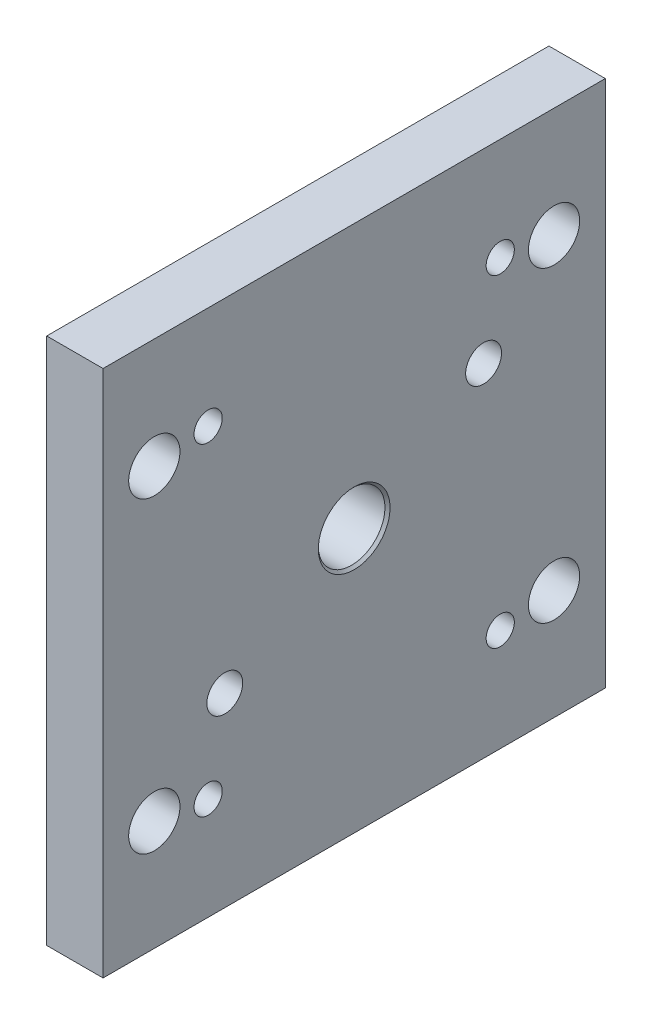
ISO-10303-21;
HEADER;
FILE_DESCRIPTION(('STEP AP214'),'2;1');
FILE_NAME('part.step','',(''),(''),'','','');
FILE_SCHEMA(('AUTOMOTIVE_DESIGN { 1 0 10303 214 1 1 1 1 }'));
ENDSEC;
DATA;
#1=APPLICATION_CONTEXT('core data for automotive mechanical design processes');
#2=APPLICATION_PROTOCOL_DEFINITION('international standard','automotive_design',2000,#1);
#3=PRODUCT_CONTEXT('',#1,'mechanical');
#4=PRODUCT('Part','Part','',(#3));
#5=PRODUCT_RELATED_PRODUCT_CATEGORY('part','',(#4));
#6=PRODUCT_DEFINITION_FORMATION('','',#4);
#7=PRODUCT_DEFINITION_CONTEXT('part definition',#1,'design');
#8=PRODUCT_DEFINITION('design','',#6,#7);
#9=PRODUCT_DEFINITION_SHAPE('','',#8);
#10=(LENGTH_UNIT() NAMED_UNIT(*) SI_UNIT(.MILLI.,.METRE.));
#11=(NAMED_UNIT(*) PLANE_ANGLE_UNIT() SI_UNIT($,.RADIAN.));
#12=(NAMED_UNIT(*) SI_UNIT($,.STERADIAN.) SOLID_ANGLE_UNIT());
#13=UNCERTAINTY_MEASURE_WITH_UNIT(LENGTH_MEASURE(1.E-05),#10,'distance_accuracy_value','');
#14=(GEOMETRIC_REPRESENTATION_CONTEXT(3) GLOBAL_UNCERTAINTY_ASSIGNED_CONTEXT((#13)) GLOBAL_UNIT_ASSIGNED_CONTEXT((#10,
#11,#12)) REPRESENTATION_CONTEXT('',''));
#15=CARTESIAN_POINT('',(0.,0.,0.));
#16=DIRECTION('',(0.,0.,1.));
#17=DIRECTION('',(1.,0.,0.));
#18=AXIS2_PLACEMENT_3D('',#15,#16,#17);
#19=CARTESIAN_POINT('',(0.,0.,0.));
#20=DIRECTION('',(1.,0.,0.));
#21=DIRECTION('',(0.,0.,-1.));
#22=AXIS2_PLACEMENT_3D('',#19,#20,#21);
#23=PLANE('',#22);
#24=CARTESIAN_POINT('',(0.,0.,0.));
#25=DIRECTION('',(1.,0.,0.));
#26=DIRECTION('',(0.,1.,0.));
#27=AXIS2_PLACEMENT_3D('',#24,#25,#26);
#28=CIRCLE('',#27,14.);
#29=CARTESIAN_POINT('',(0.,14.,0.));
#30=VERTEX_POINT('',#29);
#31=EDGE_CURVE('E48',#30,#30,#28,.F.);
#32=ORIENTED_EDGE('',*,*,#31,.T.);
#33=EDGE_LOOP('',(#32));
#34=FACE_BOUND('',#33,.T.);
#35=CARTESIAN_POINT('',(0.,30.5,-50.5000000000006));
#36=DIRECTION('',(-1.,0.,0.));
#37=DIRECTION('',(0.,0.,1.));
#38=AXIS2_PLACEMENT_3D('',#35,#36,#37);
#39=CIRCLE('',#38,6.99999999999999);
#40=CARTESIAN_POINT('',(0.,30.5,-43.5000000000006));
#41=VERTEX_POINT('',#40);
#42=EDGE_CURVE('E160',#41,#41,#39,.T.);
#43=ORIENTED_EDGE('',*,*,#42,.T.);
#44=EDGE_LOOP('',(#43));
#45=FACE_BOUND('',#44,.T.);
#46=CARTESIAN_POINT('',(0.,-30.5,50.4999999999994));
#47=DIRECTION('',(-1.,0.,0.));
#48=DIRECTION('',(0.,0.,1.));
#49=AXIS2_PLACEMENT_3D('',#46,#47,#48);
#50=CIRCLE('',#49,7.);
#51=CARTESIAN_POINT('',(0.,-30.5,57.4999999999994));
#52=VERTEX_POINT('',#51);
#53=EDGE_CURVE('E177',#52,#52,#50,.T.);
#54=ORIENTED_EDGE('',*,*,#53,.T.);
#55=EDGE_LOOP('',(#54));
#56=FACE_BOUND('',#55,.T.);
#57=DIRECTION('',(0.,0.,-1.));
#58=VECTOR('',#57,1.);
#59=CARTESIAN_POINT('',(0.,-103.,0.));
#60=LINE('',#59,#58);
#61=CARTESIAN_POINT('',(0.,-103.,97.9999999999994));
#62=VERTEX_POINT('',#61);
#63=CARTESIAN_POINT('',(0.,-103.,-98.0000000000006));
#64=VERTEX_POINT('',#63);
#65=EDGE_CURVE('E120',#62,#64,#60,.T.);
#66=ORIENTED_EDGE('',*,*,#65,.T.);
#67=DIRECTION('',(0.,-1.,0.));
#68=VECTOR('',#67,1.);
#69=CARTESIAN_POINT('',(0.,0.,-98.0000000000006));
#70=LINE('',#69,#68);
#71=CARTESIAN_POINT('',(0.,103.,-98.0000000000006));
#72=VERTEX_POINT('',#71);
#73=EDGE_CURVE('E54',#72,#64,#70,.T.);
#74=ORIENTED_EDGE('',*,*,#73,.F.);
#75=DIRECTION('',(0.,0.,-1.));
#76=VECTOR('',#75,1.);
#77=CARTESIAN_POINT('',(0.,103.,0.));
#78=LINE('',#77,#76);
#79=CARTESIAN_POINT('',(0.,103.,97.9999999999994));
#80=VERTEX_POINT('',#79);
#81=EDGE_CURVE('E82',#80,#72,#78,.T.);
#82=ORIENTED_EDGE('',*,*,#81,.F.);
#83=DIRECTION('',(0.,1.,0.));
#84=VECTOR('',#83,1.);
#85=CARTESIAN_POINT('',(0.,0.,97.9999999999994));
#86=LINE('',#85,#84);
#87=EDGE_CURVE('E86',#62,#80,#86,.T.);
#88=ORIENTED_EDGE('',*,*,#87,.F.);
#89=EDGE_LOOP('',(#66,#74,#82,#88));
#90=FACE_BOUND('',#89,.T.);
#91=CARTESIAN_POINT('',(0.,60.,-78.0000000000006));
#92=DIRECTION('',(-1.,0.,0.));
#93=DIRECTION('',(0.,0.,-1.));
#94=AXIS2_PLACEMENT_3D('',#91,#92,#93);
#95=CIRCLE('',#94,10.);
#96=CARTESIAN_POINT('',(0.,60.,-88.0000000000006));
#97=VERTEX_POINT('',#96);
#98=EDGE_CURVE('E113',#97,#97,#95,.T.);
#99=ORIENTED_EDGE('',*,*,#98,.T.);
#100=EDGE_LOOP('',(#99));
#101=FACE_BOUND('',#100,.T.);
#102=CARTESIAN_POINT('',(0.,60.,77.9999999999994));
#103=DIRECTION('',(-1.,0.,0.));
#104=DIRECTION('',(0.,0.,-1.));
#105=AXIS2_PLACEMENT_3D('',#102,#103,#104);
#106=CIRCLE('',#105,10.);
#107=CARTESIAN_POINT('',(0.,60.,67.9999999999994));
#108=VERTEX_POINT('',#107);
#109=EDGE_CURVE('E109',#108,#108,#106,.T.);
#110=ORIENTED_EDGE('',*,*,#109,.T.);
#111=EDGE_LOOP('',(#110));
#112=FACE_BOUND('',#111,.T.);
#113=CARTESIAN_POINT('',(0.,-60.,77.9999999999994));
#114=DIRECTION('',(-1.,0.,0.));
#115=DIRECTION('',(0.,0.,-1.));
#116=AXIS2_PLACEMENT_3D('',#113,#114,#115);
#117=CIRCLE('',#116,10.);
#118=CARTESIAN_POINT('',(0.,-60.,67.9999999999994));
#119=VERTEX_POINT('',#118);
#120=EDGE_CURVE('E114',#119,#119,#117,.T.);
#121=ORIENTED_EDGE('',*,*,#120,.T.);
#122=EDGE_LOOP('',(#121));
#123=FACE_BOUND('',#122,.T.);
#124=CARTESIAN_POINT('',(0.,-60.,-78.0000000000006));
#125=DIRECTION('',(-1.,0.,0.));
#126=DIRECTION('',(0.,0.,-1.));
#127=AXIS2_PLACEMENT_3D('',#124,#125,#126);
#128=CIRCLE('',#127,10.);
#129=CARTESIAN_POINT('',(0.,-60.,-88.0000000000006));
#130=VERTEX_POINT('',#129);
#131=EDGE_CURVE('E217',#130,#130,#128,.T.);
#132=ORIENTED_EDGE('',*,*,#131,.T.);
#133=EDGE_LOOP('',(#132));
#134=FACE_BOUND('',#133,.T.);
#135=CARTESIAN_POINT('',(0.,63.,-57.));
#136=DIRECTION('',(-1.,0.,0.));
#137=DIRECTION('',(0.,0.,-1.));
#138=AXIS2_PLACEMENT_3D('',#135,#136,#137);
#139=CIRCLE('',#138,5.5);
#140=CARTESIAN_POINT('',(0.,63.,-62.5));
#141=VERTEX_POINT('',#140);
#142=EDGE_CURVE('E212',#141,#141,#139,.T.);
#143=ORIENTED_EDGE('',*,*,#142,.T.);
#144=EDGE_LOOP('',(#143));
#145=FACE_BOUND('',#144,.T.);
#146=CARTESIAN_POINT('',(0.,63.,57.));
#147=DIRECTION('',(-1.,0.,0.));
#148=DIRECTION('',(0.,0.,-1.));
#149=AXIS2_PLACEMENT_3D('',#146,#147,#148);
#150=CIRCLE('',#149,5.5);
#151=CARTESIAN_POINT('',(0.,63.,51.5));
#152=VERTEX_POINT('',#151);
#153=EDGE_CURVE('E209',#152,#152,#150,.T.);
#154=ORIENTED_EDGE('',*,*,#153,.T.);
#155=EDGE_LOOP('',(#154));
#156=FACE_BOUND('',#155,.T.);
#157=CARTESIAN_POINT('',(0.,-63.,57.));
#158=DIRECTION('',(-1.,0.,0.));
#159=DIRECTION('',(0.,0.,-1.));
#160=AXIS2_PLACEMENT_3D('',#157,#158,#159);
#161=CIRCLE('',#160,5.5);
#162=CARTESIAN_POINT('',(0.,-63.,51.5));
#163=VERTEX_POINT('',#162);
#164=EDGE_CURVE('E213',#163,#163,#161,.T.);
#165=ORIENTED_EDGE('',*,*,#164,.T.);
#166=EDGE_LOOP('',(#165));
#167=FACE_BOUND('',#166,.T.);
#168=CARTESIAN_POINT('',(0.,-63.,-57.));
#169=DIRECTION('',(-1.,0.,0.));
#170=DIRECTION('',(0.,0.,-1.));
#171=AXIS2_PLACEMENT_3D('',#168,#169,#170);
#172=CIRCLE('',#171,5.5);
#173=CARTESIAN_POINT('',(0.,-63.,-62.5));
#174=VERTEX_POINT('',#173);
#175=EDGE_CURVE('E221',#174,#174,#172,.T.);
#176=ORIENTED_EDGE('',*,*,#175,.T.);
#177=EDGE_LOOP('',(#176));
#178=FACE_BOUND('',#177,.T.);
#179=ADVANCED_FACE('F38',(#34,#45,#56,#90,#101,#112,#123,#134,#145,#156,#167,#178),#23,.T.);
#180=CARTESIAN_POINT('',(-10.9999999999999,103.,0.));
#181=DIRECTION('',(0.,1.,0.));
#182=DIRECTION('',(0.,0.,1.));
#183=AXIS2_PLACEMENT_3D('',#180,#181,#182);
#184=PLANE('',#183);
#185=ORIENTED_EDGE('',*,*,#81,.T.);
#186=DIRECTION('',(1.,0.,0.));
#187=VECTOR('',#186,1.);
#188=CARTESIAN_POINT('',(-10.9999999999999,103.,-98.0000000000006));
#189=LINE('',#188,#187);
#190=CARTESIAN_POINT('',(-22.,103.,-98.0000000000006));
#191=VERTEX_POINT('',#190);
#192=EDGE_CURVE('E76',#191,#72,#189,.T.);
#193=ORIENTED_EDGE('',*,*,#192,.F.);
#194=DIRECTION('',(0.,0.,-1.));
#195=VECTOR('',#194,1.);
#196=CARTESIAN_POINT('',(-22.,103.,0.));
#197=LINE('',#196,#195);
#198=CARTESIAN_POINT('',(-22.,103.,97.9999999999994));
#199=VERTEX_POINT('',#198);
#200=EDGE_CURVE('E79',#199,#191,#197,.T.);
#201=ORIENTED_EDGE('',*,*,#200,.F.);
#202=DIRECTION('',(-1.,0.,0.));
#203=VECTOR('',#202,1.);
#204=CARTESIAN_POINT('',(-11.0000000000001,103.,97.9999999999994));
#205=LINE('',#204,#203);
#206=EDGE_CURVE('E194',#80,#199,#205,.T.);
#207=ORIENTED_EDGE('',*,*,#206,.F.);
#208=EDGE_LOOP('',(#185,#193,#201,#207));
#209=FACE_BOUND('',#208,.T.);
#210=ADVANCED_FACE('F78',(#209),#184,.T.);
#211=CARTESIAN_POINT('',(-22.,0.,0.));
#212=DIRECTION('',(-1.,0.,0.));
#213=DIRECTION('',(0.,0.,1.));
#214=AXIS2_PLACEMENT_3D('',#211,#212,#213);
#215=PLANE('',#214);
#216=CARTESIAN_POINT('',(-22.,0.,0.));
#217=DIRECTION('',(-1.,0.,0.));
#218=DIRECTION('',(0.,-1.,0.));
#219=AXIS2_PLACEMENT_3D('',#216,#217,#218);
#220=CIRCLE('',#219,14.);
#221=CARTESIAN_POINT('',(-22.,-14.,0.));
#222=VERTEX_POINT('',#221);
#223=EDGE_CURVE('E11',#222,#222,#220,.F.);
#224=ORIENTED_EDGE('',*,*,#223,.T.);
#225=EDGE_LOOP('',(#224));
#226=FACE_BOUND('',#225,.T.);
#227=CARTESIAN_POINT('',(-22.,30.5,-50.5000000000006));
#228=DIRECTION('',(-1.,0.,0.));
#229=DIRECTION('',(0.,0.,1.));
#230=AXIS2_PLACEMENT_3D('',#227,#228,#229);
#231=CIRCLE('',#230,8.99999999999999);
#232=CARTESIAN_POINT('',(-22.,30.5,-41.5000000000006));
#233=VERTEX_POINT('',#232);
#234=EDGE_CURVE('E153',#233,#233,#231,.T.);
#235=ORIENTED_EDGE('',*,*,#234,.F.);
#236=EDGE_LOOP('',(#235));
#237=FACE_BOUND('',#236,.T.);
#238=CARTESIAN_POINT('',(-22.,-30.5,50.4999999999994));
#239=DIRECTION('',(-1.,0.,0.));
#240=DIRECTION('',(0.,0.,1.));
#241=AXIS2_PLACEMENT_3D('',#238,#239,#240);
#242=CIRCLE('',#241,9.);
#243=CARTESIAN_POINT('',(-22.,-30.5,59.4999999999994));
#244=VERTEX_POINT('',#243);
#245=EDGE_CURVE('E156',#244,#244,#242,.T.);
#246=ORIENTED_EDGE('',*,*,#245,.F.);
#247=EDGE_LOOP('',(#246));
#248=FACE_BOUND('',#247,.T.);
#249=ORIENTED_EDGE('',*,*,#200,.T.);
#250=DIRECTION('',(0.,1.,0.));
#251=VECTOR('',#250,1.);
#252=CARTESIAN_POINT('',(-22.,0.,-98.0000000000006));
#253=LINE('',#252,#251);
#254=CARTESIAN_POINT('',(-22.,-103.,-98.0000000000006));
#255=VERTEX_POINT('',#254);
#256=EDGE_CURVE('E85',#255,#191,#253,.T.);
#257=ORIENTED_EDGE('',*,*,#256,.F.);
#258=DIRECTION('',(0.,0.,-1.));
#259=VECTOR('',#258,1.);
#260=CARTESIAN_POINT('',(-22.,-103.,0.));
#261=LINE('',#260,#259);
#262=CARTESIAN_POINT('',(-22.,-103.,97.9999999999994));
#263=VERTEX_POINT('',#262);
#264=EDGE_CURVE('E187',#263,#255,#261,.T.);
#265=ORIENTED_EDGE('',*,*,#264,.F.);
#266=DIRECTION('',(0.,-1.,0.));
#267=VECTOR('',#266,1.);
#268=CARTESIAN_POINT('',(-22.,0.,97.9999999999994));
#269=LINE('',#268,#267);
#270=EDGE_CURVE('E93',#199,#263,#269,.T.);
#271=ORIENTED_EDGE('',*,*,#270,.F.);
#272=EDGE_LOOP('',(#249,#257,#265,#271));
#273=FACE_BOUND('',#272,.T.);
#274=CARTESIAN_POINT('',(-22.,60.,-78.0000000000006));
#275=DIRECTION('',(1.,0.,0.));
#276=DIRECTION('',(0.,0.,-1.));
#277=AXIS2_PLACEMENT_3D('',#274,#275,#276);
#278=CIRCLE('',#277,10.);
#279=CARTESIAN_POINT('',(-22.,60.,-88.0000000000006));
#280=VERTEX_POINT('',#279);
#281=EDGE_CURVE('E95',#280,#280,#278,.T.);
#282=ORIENTED_EDGE('',*,*,#281,.T.);
#283=EDGE_LOOP('',(#282));
#284=FACE_BOUND('',#283,.T.);
#285=CARTESIAN_POINT('',(-22.,60.,77.9999999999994));
#286=DIRECTION('',(1.,0.,0.));
#287=DIRECTION('',(0.,0.,-1.));
#288=AXIS2_PLACEMENT_3D('',#285,#286,#287);
#289=CIRCLE('',#288,10.);
#290=CARTESIAN_POINT('',(-22.,60.,67.9999999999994));
#291=VERTEX_POINT('',#290);
#292=EDGE_CURVE('E201',#291,#291,#289,.T.);
#293=ORIENTED_EDGE('',*,*,#292,.T.);
#294=EDGE_LOOP('',(#293));
#295=FACE_BOUND('',#294,.T.);
#296=CARTESIAN_POINT('',(-22.,-60.,77.9999999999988));
#297=DIRECTION('',(1.,0.,0.));
#298=DIRECTION('',(0.,0.,-1.));
#299=AXIS2_PLACEMENT_3D('',#296,#297,#298);
#300=CIRCLE('',#299,10.);
#301=CARTESIAN_POINT('',(-22.,-60.,67.9999999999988));
#302=VERTEX_POINT('',#301);
#303=EDGE_CURVE('E197',#302,#302,#300,.T.);
#304=ORIENTED_EDGE('',*,*,#303,.T.);
#305=EDGE_LOOP('',(#304));
#306=FACE_BOUND('',#305,.T.);
#307=CARTESIAN_POINT('',(-22.,-60.,-78.0000000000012));
#308=DIRECTION('',(1.,0.,0.));
#309=DIRECTION('',(0.,0.,-1.));
#310=AXIS2_PLACEMENT_3D('',#307,#308,#309);
#311=CIRCLE('',#310,10.);
#312=CARTESIAN_POINT('',(-22.,-60.,-88.0000000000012));
#313=VERTEX_POINT('',#312);
#314=EDGE_CURVE('E202',#313,#313,#311,.T.);
#315=ORIENTED_EDGE('',*,*,#314,.T.);
#316=EDGE_LOOP('',(#315));
#317=FACE_BOUND('',#316,.T.);
#318=CARTESIAN_POINT('',(-22.,63.,-57.));
#319=DIRECTION('',(1.,0.,0.));
#320=DIRECTION('',(0.,0.,-1.));
#321=AXIS2_PLACEMENT_3D('',#318,#319,#320);
#322=CIRCLE('',#321,9.);
#323=CARTESIAN_POINT('',(-22.,63.,-66.));
#324=VERTEX_POINT('',#323);
#325=EDGE_CURVE('E260',#324,#324,#322,.T.);
#326=ORIENTED_EDGE('',*,*,#325,.T.);
#327=EDGE_LOOP('',(#326));
#328=FACE_BOUND('',#327,.T.);
#329=CARTESIAN_POINT('',(-22.,63.,57.));
#330=DIRECTION('',(1.,0.,0.));
#331=DIRECTION('',(0.,0.,-1.));
#332=AXIS2_PLACEMENT_3D('',#329,#330,#331);
#333=CIRCLE('',#332,9.);
#334=CARTESIAN_POINT('',(-22.,63.,48.));
#335=VERTEX_POINT('',#334);
#336=EDGE_CURVE('E244',#335,#335,#333,.T.);
#337=ORIENTED_EDGE('',*,*,#336,.T.);
#338=EDGE_LOOP('',(#337));
#339=FACE_BOUND('',#338,.T.);
#340=CARTESIAN_POINT('',(-22.,-63.,57.));
#341=DIRECTION('',(1.,0.,0.));
#342=DIRECTION('',(0.,0.,-1.));
#343=AXIS2_PLACEMENT_3D('',#340,#341,#342);
#344=CIRCLE('',#343,9.);
#345=CARTESIAN_POINT('',(-22.,-63.,48.));
#346=VERTEX_POINT('',#345);
#347=EDGE_CURVE('E186',#346,#346,#344,.T.);
#348=ORIENTED_EDGE('',*,*,#347,.T.);
#349=EDGE_LOOP('',(#348));
#350=FACE_BOUND('',#349,.T.);
#351=CARTESIAN_POINT('',(-22.,-63.,-57.));
#352=DIRECTION('',(1.,0.,0.));
#353=DIRECTION('',(0.,0.,-1.));
#354=AXIS2_PLACEMENT_3D('',#351,#352,#353);
#355=CIRCLE('',#354,9.);
#356=CARTESIAN_POINT('',(-22.,-63.,-66.));
#357=VERTEX_POINT('',#356);
#358=EDGE_CURVE('E182',#357,#357,#355,.T.);
#359=ORIENTED_EDGE('',*,*,#358,.T.);
#360=EDGE_LOOP('',(#359));
#361=FACE_BOUND('',#360,.T.);
#362=ADVANCED_FACE('F90',(#226,#237,#248,#273,#284,#295,#306,#317,#328,#339,#350,#361),#215,.T.);
#363=CARTESIAN_POINT('',(-10.9999999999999,-103.,0.));
#364=DIRECTION('',(0.,-1.,0.));
#365=DIRECTION('',(0.,0.,-1.));
#366=AXIS2_PLACEMENT_3D('',#363,#364,#365);
#367=PLANE('',#366);
#368=ORIENTED_EDGE('',*,*,#264,.T.);
#369=DIRECTION('',(-1.,0.,0.));
#370=VECTOR('',#369,1.);
#371=CARTESIAN_POINT('',(-10.9999999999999,-103.,-98.0000000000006));
#372=LINE('',#371,#370);
#373=EDGE_CURVE('E99',#64,#255,#372,.T.);
#374=ORIENTED_EDGE('',*,*,#373,.F.);
#375=ORIENTED_EDGE('',*,*,#65,.F.);
#376=DIRECTION('',(1.,0.,0.));
#377=VECTOR('',#376,1.);
#378=CARTESIAN_POINT('',(-11.0000000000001,-103.,97.9999999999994));
#379=LINE('',#378,#377);
#380=EDGE_CURVE('E256',#263,#62,#379,.T.);
#381=ORIENTED_EDGE('',*,*,#380,.F.);
#382=EDGE_LOOP('',(#368,#374,#375,#381));
#383=FACE_BOUND('',#382,.T.);
#384=ADVANCED_FACE('F148',(#383),#367,.T.);
#385=CARTESIAN_POINT('',(-10.9999999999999,0.,-98.0000000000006));
#386=DIRECTION('',(0.,0.,-1.));
#387=DIRECTION('',(-1.,0.,0.));
#388=AXIS2_PLACEMENT_3D('',#385,#386,#387);
#389=PLANE('',#388);
#390=ORIENTED_EDGE('',*,*,#73,.T.);
#391=ORIENTED_EDGE('',*,*,#373,.T.);
#392=ORIENTED_EDGE('',*,*,#256,.T.);
#393=ORIENTED_EDGE('',*,*,#192,.T.);
#394=EDGE_LOOP('',(#390,#391,#392,#393));
#395=FACE_BOUND('',#394,.T.);
#396=ADVANCED_FACE('F97',(#395),#389,.T.);
#397=CARTESIAN_POINT('',(-11.0000000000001,0.,97.9999999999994));
#398=DIRECTION('',(0.,0.,1.));
#399=DIRECTION('',(1.,0.,0.));
#400=AXIS2_PLACEMENT_3D('',#397,#398,#399);
#401=PLANE('',#400);
#402=ORIENTED_EDGE('',*,*,#87,.T.);
#403=ORIENTED_EDGE('',*,*,#206,.T.);
#404=ORIENTED_EDGE('',*,*,#270,.T.);
#405=ORIENTED_EDGE('',*,*,#380,.T.);
#406=EDGE_LOOP('',(#402,#403,#404,#405));
#407=FACE_BOUND('',#406,.T.);
#408=ADVANCED_FACE('F290',(#407),#401,.T.);
#409=CARTESIAN_POINT('',(-10.9999999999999,60.,-78.0000000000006));
#410=DIRECTION('',(-1.,0.,0.));
#411=DIRECTION('',(0.,0.,1.));
#412=AXIS2_PLACEMENT_3D('',#409,#410,#411);
#413=CYLINDRICAL_SURFACE('',#412,10.);
#414=ORIENTED_EDGE('',*,*,#98,.F.);
#415=EDGE_LOOP('',(#414));
#416=FACE_BOUND('',#415,.T.);
#417=ORIENTED_EDGE('',*,*,#281,.F.);
#418=EDGE_LOOP('',(#417));
#419=FACE_BOUND('',#418,.T.);
#420=ADVANCED_FACE('F287',(#416,#419),#413,.F.);
#421=CARTESIAN_POINT('',(-11.0000000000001,60.,77.9999999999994));
#422=DIRECTION('',(-1.,0.,0.));
#423=DIRECTION('',(0.,0.,1.));
#424=AXIS2_PLACEMENT_3D('',#421,#422,#423);
#425=CYLINDRICAL_SURFACE('',#424,10.);
#426=ORIENTED_EDGE('',*,*,#109,.F.);
#427=EDGE_LOOP('',(#426));
#428=FACE_BOUND('',#427,.T.);
#429=ORIENTED_EDGE('',*,*,#292,.F.);
#430=EDGE_LOOP('',(#429));
#431=FACE_BOUND('',#430,.T.);
#432=ADVANCED_FACE('F289',(#428,#431),#425,.F.);
#433=CARTESIAN_POINT('',(-11.0000000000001,-60.,77.9999999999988));
#434=DIRECTION('',(-1.,0.,0.));
#435=DIRECTION('',(0.,0.,1.));
#436=AXIS2_PLACEMENT_3D('',#433,#434,#435);
#437=CYLINDRICAL_SURFACE('',#436,10.);
#438=ORIENTED_EDGE('',*,*,#120,.F.);
#439=EDGE_LOOP('',(#438));
#440=FACE_BOUND('',#439,.T.);
#441=ORIENTED_EDGE('',*,*,#303,.F.);
#442=EDGE_LOOP('',(#441));
#443=FACE_BOUND('',#442,.T.);
#444=ADVANCED_FACE('F297',(#440,#443),#437,.F.);
#445=CARTESIAN_POINT('',(-10.9999999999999,-60.,-78.0000000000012));
#446=DIRECTION('',(-1.,0.,0.));
#447=DIRECTION('',(0.,0.,1.));
#448=AXIS2_PLACEMENT_3D('',#445,#446,#447);
#449=CYLINDRICAL_SURFACE('',#448,10.);
#450=ORIENTED_EDGE('',*,*,#131,.F.);
#451=EDGE_LOOP('',(#450));
#452=FACE_BOUND('',#451,.T.);
#453=ORIENTED_EDGE('',*,*,#314,.F.);
#454=EDGE_LOOP('',(#453));
#455=FACE_BOUND('',#454,.T.);
#456=ADVANCED_FACE('F389',(#452,#455),#449,.F.);
#457=CARTESIAN_POINT('',(-10.9999999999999,63.,-56.9999999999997));
#458=DIRECTION('',(-1.,0.,0.));
#459=DIRECTION('',(0.,0.,1.));
#460=AXIS2_PLACEMENT_3D('',#457,#458,#459);
#461=CYLINDRICAL_SURFACE('',#460,5.5);
#462=ORIENTED_EDGE('',*,*,#142,.F.);
#463=EDGE_LOOP('',(#462));
#464=FACE_BOUND('',#463,.T.);
#465=CARTESIAN_POINT('',(-8.9999999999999,63.,-56.9999999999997));
#466=DIRECTION('',(-1.,0.,0.));
#467=DIRECTION('',(0.,0.,-1.));
#468=AXIS2_PLACEMENT_3D('',#465,#466,#467);
#469=CIRCLE('',#468,5.5);
#470=CARTESIAN_POINT('',(-8.9999999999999,63.,-62.4999999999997));
#471=VERTEX_POINT('',#470);
#472=EDGE_CURVE('E181',#471,#471,#469,.T.);
#473=ORIENTED_EDGE('',*,*,#472,.T.);
#474=EDGE_LOOP('',(#473));
#475=FACE_BOUND('',#474,.T.);
#476=ADVANCED_FACE('F384',(#464,#475),#461,.F.);
#477=CARTESIAN_POINT('',(-11.0000000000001,63.,57.0000000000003));
#478=DIRECTION('',(-1.,0.,0.));
#479=DIRECTION('',(0.,0.,1.));
#480=AXIS2_PLACEMENT_3D('',#477,#478,#479);
#481=CYLINDRICAL_SURFACE('',#480,5.5);
#482=ORIENTED_EDGE('',*,*,#153,.F.);
#483=EDGE_LOOP('',(#482));
#484=FACE_BOUND('',#483,.T.);
#485=CARTESIAN_POINT('',(-9.00000000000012,63.,57.0000000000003));
#486=DIRECTION('',(-1.,0.,0.));
#487=DIRECTION('',(0.,0.,-1.));
#488=AXIS2_PLACEMENT_3D('',#485,#486,#487);
#489=CIRCLE('',#488,5.5);
#490=CARTESIAN_POINT('',(-9.00000000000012,63.,51.5000000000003));
#491=VERTEX_POINT('',#490);
#492=EDGE_CURVE('E231',#491,#491,#489,.T.);
#493=ORIENTED_EDGE('',*,*,#492,.T.);
#494=EDGE_LOOP('',(#493));
#495=FACE_BOUND('',#494,.T.);
#496=ADVANCED_FACE('F357',(#484,#495),#481,.F.);
#497=CARTESIAN_POINT('',(-11.0000000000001,-63.,57.0000000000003));
#498=DIRECTION('',(-1.,0.,0.));
#499=DIRECTION('',(0.,0.,1.));
#500=AXIS2_PLACEMENT_3D('',#497,#498,#499);
#501=CYLINDRICAL_SURFACE('',#500,5.5);
#502=ORIENTED_EDGE('',*,*,#164,.F.);
#503=EDGE_LOOP('',(#502));
#504=FACE_BOUND('',#503,.T.);
#505=CARTESIAN_POINT('',(-9.00000000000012,-63.,57.0000000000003));
#506=DIRECTION('',(-1.,0.,0.));
#507=DIRECTION('',(0.,0.,-1.));
#508=AXIS2_PLACEMENT_3D('',#505,#506,#507);
#509=CIRCLE('',#508,5.5);
#510=CARTESIAN_POINT('',(-9.00000000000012,-63.,51.5000000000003));
#511=VERTEX_POINT('',#510);
#512=EDGE_CURVE('E226',#511,#511,#509,.T.);
#513=ORIENTED_EDGE('',*,*,#512,.T.);
#514=EDGE_LOOP('',(#513));
#515=FACE_BOUND('',#514,.T.);
#516=ADVANCED_FACE('F351',(#504,#515),#501,.F.);
#517=CARTESIAN_POINT('',(-10.9999999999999,-63.,-56.9999999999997));
#518=DIRECTION('',(-1.,0.,0.));
#519=DIRECTION('',(0.,0.,1.));
#520=AXIS2_PLACEMENT_3D('',#517,#518,#519);
#521=CYLINDRICAL_SURFACE('',#520,5.5);
#522=ORIENTED_EDGE('',*,*,#175,.F.);
#523=EDGE_LOOP('',(#522));
#524=FACE_BOUND('',#523,.T.);
#525=CARTESIAN_POINT('',(-8.9999999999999,-63.,-56.9999999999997));
#526=DIRECTION('',(-1.,0.,0.));
#527=DIRECTION('',(0.,0.,-1.));
#528=AXIS2_PLACEMENT_3D('',#525,#526,#527);
#529=CIRCLE('',#528,5.5);
#530=CARTESIAN_POINT('',(-8.9999999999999,-63.,-62.4999999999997));
#531=VERTEX_POINT('',#530);
#532=EDGE_CURVE('E188',#531,#531,#529,.T.);
#533=ORIENTED_EDGE('',*,*,#532,.T.);
#534=EDGE_LOOP('',(#533));
#535=FACE_BOUND('',#534,.T.);
#536=ADVANCED_FACE('F323',(#524,#535),#521,.F.);
#537=CARTESIAN_POINT('',(-8.9999999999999,63.,-56.9999999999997));
#538=DIRECTION('',(-1.,0.,0.));
#539=DIRECTION('',(0.,0.,1.));
#540=AXIS2_PLACEMENT_3D('',#537,#538,#539);
#541=PLANE('',#540);
#542=CARTESIAN_POINT('',(-8.9999999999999,63.,-56.9999999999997));
#543=DIRECTION('',(1.,0.,0.));
#544=DIRECTION('',(0.,0.,-1.));
#545=AXIS2_PLACEMENT_3D('',#542,#543,#544);
#546=CIRCLE('',#545,9.);
#547=CARTESIAN_POINT('',(-8.9999999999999,63.,-65.9999999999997));
#548=VERTEX_POINT('',#547);
#549=EDGE_CURVE('E222',#548,#548,#546,.T.);
#550=ORIENTED_EDGE('',*,*,#549,.F.);
#551=EDGE_LOOP('',(#550));
#552=FACE_BOUND('',#551,.T.);
#553=ORIENTED_EDGE('',*,*,#472,.F.);
#554=EDGE_LOOP('',(#553));
#555=FACE_BOUND('',#554,.T.);
#556=ADVANCED_FACE('F319',(#552,#555),#541,.T.);
#557=CARTESIAN_POINT('',(-15.4999999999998,63.,-57.));
#558=DIRECTION('',(-1.,0.,0.));
#559=DIRECTION('',(0.,0.,1.));
#560=AXIS2_PLACEMENT_3D('',#557,#558,#559);
#561=CYLINDRICAL_SURFACE('',#560,9.);
#562=ORIENTED_EDGE('',*,*,#549,.T.);
#563=EDGE_LOOP('',(#562));
#564=FACE_BOUND('',#563,.T.);
#565=ORIENTED_EDGE('',*,*,#325,.F.);
#566=EDGE_LOOP('',(#565));
#567=FACE_BOUND('',#566,.T.);
#568=ADVANCED_FACE('F322',(#564,#567),#561,.F.);
#569=CARTESIAN_POINT('',(-9.00000000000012,63.,57.0000000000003));
#570=DIRECTION('',(-1.,0.,0.));
#571=DIRECTION('',(0.,0.,1.));
#572=AXIS2_PLACEMENT_3D('',#569,#570,#571);
#573=PLANE('',#572);
#574=CARTESIAN_POINT('',(-9.00000000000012,63.,57.0000000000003));
#575=DIRECTION('',(1.,0.,0.));
#576=DIRECTION('',(0.,0.,-1.));
#577=AXIS2_PLACEMENT_3D('',#574,#575,#576);
#578=CIRCLE('',#577,9.);
#579=CARTESIAN_POINT('',(-9.00000000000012,63.,48.0000000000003));
#580=VERTEX_POINT('',#579);
#581=EDGE_CURVE('E192',#580,#580,#578,.T.);
#582=ORIENTED_EDGE('',*,*,#581,.F.);
#583=EDGE_LOOP('',(#582));
#584=FACE_BOUND('',#583,.T.);
#585=ORIENTED_EDGE('',*,*,#492,.F.);
#586=EDGE_LOOP('',(#585));
#587=FACE_BOUND('',#586,.T.);
#588=ADVANCED_FACE('F325',(#584,#587),#573,.T.);
#589=CARTESIAN_POINT('',(-15.5000000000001,63.,57.));
#590=DIRECTION('',(-1.,0.,0.));
#591=DIRECTION('',(0.,0.,1.));
#592=AXIS2_PLACEMENT_3D('',#589,#590,#591);
#593=CYLINDRICAL_SURFACE('',#592,9.);
#594=ORIENTED_EDGE('',*,*,#581,.T.);
#595=EDGE_LOOP('',(#594));
#596=FACE_BOUND('',#595,.T.);
#597=ORIENTED_EDGE('',*,*,#336,.F.);
#598=EDGE_LOOP('',(#597));
#599=FACE_BOUND('',#598,.T.);
#600=ADVANCED_FACE('F328',(#596,#599),#593,.F.);
#601=CARTESIAN_POINT('',(-9.00000000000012,-63.,57.0000000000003));
#602=DIRECTION('',(-1.,0.,0.));
#603=DIRECTION('',(0.,0.,1.));
#604=AXIS2_PLACEMENT_3D('',#601,#602,#603);
#605=PLANE('',#604);
#606=CARTESIAN_POINT('',(-9.00000000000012,-63.,57.0000000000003));
#607=DIRECTION('',(1.,0.,0.));
#608=DIRECTION('',(0.,0.,-1.));
#609=AXIS2_PLACEMENT_3D('',#606,#607,#608);
#610=CIRCLE('',#609,9.);
#611=CARTESIAN_POINT('',(-9.00000000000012,-63.,48.0000000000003));
#612=VERTEX_POINT('',#611);
#613=EDGE_CURVE('E227',#612,#612,#610,.T.);
#614=ORIENTED_EDGE('',*,*,#613,.F.);
#615=EDGE_LOOP('',(#614));
#616=FACE_BOUND('',#615,.T.);
#617=ORIENTED_EDGE('',*,*,#512,.F.);
#618=EDGE_LOOP('',(#617));
#619=FACE_BOUND('',#618,.T.);
#620=ADVANCED_FACE('F330',(#616,#619),#605,.T.);
#621=CARTESIAN_POINT('',(-15.5000000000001,-63.,57.0000000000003));
#622=DIRECTION('',(-1.,0.,0.));
#623=DIRECTION('',(0.,0.,1.));
#624=AXIS2_PLACEMENT_3D('',#621,#622,#623);
#625=CYLINDRICAL_SURFACE('',#624,9.);
#626=ORIENTED_EDGE('',*,*,#613,.T.);
#627=EDGE_LOOP('',(#626));
#628=FACE_BOUND('',#627,.T.);
#629=ORIENTED_EDGE('',*,*,#347,.F.);
#630=EDGE_LOOP('',(#629));
#631=FACE_BOUND('',#630,.T.);
#632=ADVANCED_FACE('F332',(#628,#631),#625,.F.);
#633=CARTESIAN_POINT('',(-8.9999999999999,-63.,-56.9999999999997));
#634=DIRECTION('',(-1.,0.,0.));
#635=DIRECTION('',(0.,0.,1.));
#636=AXIS2_PLACEMENT_3D('',#633,#634,#635);
#637=PLANE('',#636);
#638=CARTESIAN_POINT('',(-8.9999999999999,-63.,-56.9999999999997));
#639=DIRECTION('',(1.,0.,0.));
#640=DIRECTION('',(0.,0.,-1.));
#641=AXIS2_PLACEMENT_3D('',#638,#639,#640);
#642=CIRCLE('',#641,9.);
#643=CARTESIAN_POINT('',(-8.9999999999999,-63.,-65.9999999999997));
#644=VERTEX_POINT('',#643);
#645=EDGE_CURVE('E205',#644,#644,#642,.T.);
#646=ORIENTED_EDGE('',*,*,#645,.F.);
#647=EDGE_LOOP('',(#646));
#648=FACE_BOUND('',#647,.T.);
#649=ORIENTED_EDGE('',*,*,#532,.F.);
#650=EDGE_LOOP('',(#649));
#651=FACE_BOUND('',#650,.T.);
#652=ADVANCED_FACE('F334',(#648,#651),#637,.T.);
#653=CARTESIAN_POINT('',(-15.4999999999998,-63.,-56.9999999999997));
#654=DIRECTION('',(-1.,0.,0.));
#655=DIRECTION('',(0.,0.,1.));
#656=AXIS2_PLACEMENT_3D('',#653,#654,#655);
#657=CYLINDRICAL_SURFACE('',#656,9.);
#658=ORIENTED_EDGE('',*,*,#645,.T.);
#659=EDGE_LOOP('',(#658));
#660=FACE_BOUND('',#659,.T.);
#661=ORIENTED_EDGE('',*,*,#358,.F.);
#662=EDGE_LOOP('',(#661));
#663=FACE_BOUND('',#662,.T.);
#664=ADVANCED_FACE('F336',(#660,#663),#657,.F.);
#665=CARTESIAN_POINT('',(-22.,-30.5,50.4999999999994));
#666=DIRECTION('',(-1.,0.,0.));
#667=DIRECTION('',(0.,0.,1.));
#668=AXIS2_PLACEMENT_3D('',#665,#666,#667);
#669=CYLINDRICAL_SURFACE('',#668,7.);
#670=ORIENTED_EDGE('',*,*,#53,.F.);
#671=EDGE_LOOP('',(#670));
#672=FACE_BOUND('',#671,.T.);
#673=CARTESIAN_POINT('',(-17.0000000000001,-30.5,50.4999999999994));
#674=DIRECTION('',(-1.,0.,0.));
#675=DIRECTION('',(0.,0.,1.));
#676=AXIS2_PLACEMENT_3D('',#673,#674,#675);
#677=CIRCLE('',#676,7.);
#678=CARTESIAN_POINT('',(-17.0000000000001,-30.5,57.4999999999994));
#679=VERTEX_POINT('',#678);
#680=EDGE_CURVE('E166',#679,#679,#677,.T.);
#681=ORIENTED_EDGE('',*,*,#680,.T.);
#682=EDGE_LOOP('',(#681));
#683=FACE_BOUND('',#682,.T.);
#684=ADVANCED_FACE('F311',(#672,#683),#669,.F.);
#685=CARTESIAN_POINT('',(-17.0000000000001,-23.5,50.4999999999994));
#686=DIRECTION('',(1.,0.,0.));
#687=DIRECTION('',(0.,0.,-1.));
#688=AXIS2_PLACEMENT_3D('',#685,#686,#687);
#689=PLANE('',#688);
#690=ORIENTED_EDGE('',*,*,#680,.F.);
#691=EDGE_LOOP('',(#690));
#692=FACE_BOUND('',#691,.T.);
#693=CARTESIAN_POINT('',(-17.0000000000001,-30.5,50.4999999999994));
#694=DIRECTION('',(-1.,0.,0.));
#695=DIRECTION('',(0.,0.,1.));
#696=AXIS2_PLACEMENT_3D('',#693,#694,#695);
#697=CIRCLE('',#696,9.);
#698=CARTESIAN_POINT('',(-17.0000000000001,-30.5,59.4999999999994));
#699=VERTEX_POINT('',#698);
#700=EDGE_CURVE('E159',#699,#699,#697,.T.);
#701=ORIENTED_EDGE('',*,*,#700,.T.);
#702=EDGE_LOOP('',(#701));
#703=FACE_BOUND('',#702,.T.);
#704=ADVANCED_FACE('F488',(#692,#703),#689,.F.);
#705=CARTESIAN_POINT('',(-22.,-30.5,50.4999999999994));
#706=DIRECTION('',(-1.,0.,0.));
#707=DIRECTION('',(0.,0.,1.));
#708=AXIS2_PLACEMENT_3D('',#705,#706,#707);
#709=CYLINDRICAL_SURFACE('',#708,9.);
#710=ORIENTED_EDGE('',*,*,#700,.F.);
#711=EDGE_LOOP('',(#710));
#712=FACE_BOUND('',#711,.T.);
#713=ORIENTED_EDGE('',*,*,#245,.T.);
#714=EDGE_LOOP('',(#713));
#715=FACE_BOUND('',#714,.T.);
#716=ADVANCED_FACE('F496',(#712,#715),#709,.F.);
#717=CARTESIAN_POINT('',(-22.,30.5,-50.5000000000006));
#718=DIRECTION('',(-1.,0.,0.));
#719=DIRECTION('',(0.,0.,1.));
#720=AXIS2_PLACEMENT_3D('',#717,#718,#719);
#721=CYLINDRICAL_SURFACE('',#720,7.);
#722=ORIENTED_EDGE('',*,*,#42,.F.);
#723=EDGE_LOOP('',(#722));
#724=FACE_BOUND('',#723,.T.);
#725=CARTESIAN_POINT('',(-16.9999999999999,30.5,-50.5000000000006));
#726=DIRECTION('',(-1.,0.,0.));
#727=DIRECTION('',(0.,0.,1.));
#728=AXIS2_PLACEMENT_3D('',#725,#726,#727);
#729=CIRCLE('',#728,7.);
#730=CARTESIAN_POINT('',(-16.9999999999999,30.5,-43.5000000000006));
#731=VERTEX_POINT('',#730);
#732=EDGE_CURVE('E170',#731,#731,#729,.T.);
#733=ORIENTED_EDGE('',*,*,#732,.T.);
#734=EDGE_LOOP('',(#733));
#735=FACE_BOUND('',#734,.T.);
#736=ADVANCED_FACE('F504',(#724,#735),#721,.F.);
#737=CARTESIAN_POINT('',(-16.9999999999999,37.5,-50.5000000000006));
#738=DIRECTION('',(1.,0.,0.));
#739=DIRECTION('',(0.,0.,-1.));
#740=AXIS2_PLACEMENT_3D('',#737,#738,#739);
#741=PLANE('',#740);
#742=ORIENTED_EDGE('',*,*,#732,.F.);
#743=EDGE_LOOP('',(#742));
#744=FACE_BOUND('',#743,.T.);
#745=CARTESIAN_POINT('',(-16.9999999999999,30.5,-50.5000000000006));
#746=DIRECTION('',(-1.,0.,0.));
#747=DIRECTION('',(0.,0.,1.));
#748=AXIS2_PLACEMENT_3D('',#745,#746,#747);
#749=CIRCLE('',#748,9.);
#750=CARTESIAN_POINT('',(-16.9999999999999,30.5,-41.5000000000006));
#751=VERTEX_POINT('',#750);
#752=EDGE_CURVE('E1048',#751,#751,#749,.T.);
#753=ORIENTED_EDGE('',*,*,#752,.T.);
#754=EDGE_LOOP('',(#753));
#755=FACE_BOUND('',#754,.T.);
#756=ADVANCED_FACE('F513',(#744,#755),#741,.F.);
#757=CARTESIAN_POINT('',(-22.,30.5,-50.5000000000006));
#758=DIRECTION('',(-1.,0.,0.));
#759=DIRECTION('',(0.,0.,1.));
#760=AXIS2_PLACEMENT_3D('',#757,#758,#759);
#761=CYLINDRICAL_SURFACE('',#760,9.);
#762=ORIENTED_EDGE('',*,*,#752,.F.);
#763=EDGE_LOOP('',(#762));
#764=FACE_BOUND('',#763,.T.);
#765=ORIENTED_EDGE('',*,*,#234,.T.);
#766=EDGE_LOOP('',(#765));
#767=FACE_BOUND('',#766,.T.);
#768=ADVANCED_FACE('F138',(#764,#767),#761,.F.);
#769=CARTESIAN_POINT('',(-22.,0.,0.));
#770=DIRECTION('',(1.,0.,0.));
#771=DIRECTION('',(0.,1.,0.));
#772=AXIS2_PLACEMENT_3D('',#769,#770,#771);
#773=CYLINDRICAL_SURFACE('',#772,13.);
#774=CARTESIAN_POINT('',(-1.,0.,0.));
#775=DIRECTION('',(1.,0.,0.));
#776=DIRECTION('',(0.,1.,0.));
#777=AXIS2_PLACEMENT_3D('',#774,#775,#776);
#778=CIRCLE('',#777,13.);
#779=CARTESIAN_POINT('',(-1.,13.,0.));
#780=VERTEX_POINT('',#779);
#781=EDGE_CURVE('E119',#780,#780,#778,.T.);
#782=ORIENTED_EDGE('',*,*,#781,.T.);
#783=EDGE_LOOP('',(#782));
#784=FACE_BOUND('',#783,.T.);
#785=CARTESIAN_POINT('',(-21.0000000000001,0.,0.));
#786=DIRECTION('',(-1.,0.,0.));
#787=DIRECTION('',(0.,-1.,0.));
#788=AXIS2_PLACEMENT_3D('',#785,#786,#787);
#789=CIRCLE('',#788,13.);
#790=CARTESIAN_POINT('',(-21.0000000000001,-13.,0.));
#791=VERTEX_POINT('',#790);
#792=EDGE_CURVE('E115',#791,#791,#789,.T.);
#793=ORIENTED_EDGE('',*,*,#792,.T.);
#794=EDGE_LOOP('',(#793));
#795=FACE_BOUND('',#794,.T.);
#796=ADVANCED_FACE('F133',(#784,#795),#773,.F.);
#797=CARTESIAN_POINT('',(-1.,0.,0.));
#798=DIRECTION('',(1.,0.,0.));
#799=DIRECTION('',(0.,1.,0.));
#800=AXIS2_PLACEMENT_3D('',#797,#798,#799);
#801=CONICAL_SURFACE('',#800,13.,0.785398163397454);
#802=ORIENTED_EDGE('',*,*,#31,.F.);
#803=EDGE_LOOP('',(#802));
#804=FACE_BOUND('',#803,.T.);
#805=ORIENTED_EDGE('',*,*,#781,.F.);
#806=EDGE_LOOP('',(#805));
#807=FACE_BOUND('',#806,.T.);
#808=ADVANCED_FACE('F130',(#804,#807),#801,.F.);
#809=CARTESIAN_POINT('',(-22.,0.,0.));
#810=DIRECTION('',(-1.,0.,0.));
#811=DIRECTION('',(0.,-1.,0.));
#812=AXIS2_PLACEMENT_3D('',#809,#810,#811);
#813=CONICAL_SURFACE('',#812,14.,0.785398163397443);
#814=ORIENTED_EDGE('',*,*,#792,.F.);
#815=EDGE_LOOP('',(#814));
#816=FACE_BOUND('',#815,.T.);
#817=ORIENTED_EDGE('',*,*,#223,.F.);
#818=EDGE_LOOP('',(#817));
#819=FACE_BOUND('',#818,.T.);
#820=ADVANCED_FACE('F40',(#816,#819),#813,.F.);
#821=CLOSED_SHELL('',(#179,#210,#362,#384,#396,#408,#420,#432,#444,#456,#476,#496,#516,#536,
#556,#568,#588,#600,#620,#632,#652,#664,#684,#704,#716,#736,#756,#768,#796,#808,#820));
#822=MANIFOLD_SOLID_BREP('B2',#821);
#823=ADVANCED_BREP_SHAPE_REPRESENTATION('',(#18,#822),#14);
#824=SHAPE_DEFINITION_REPRESENTATION(#9,#823);
ENDSEC;
END-ISO-10303-21;
